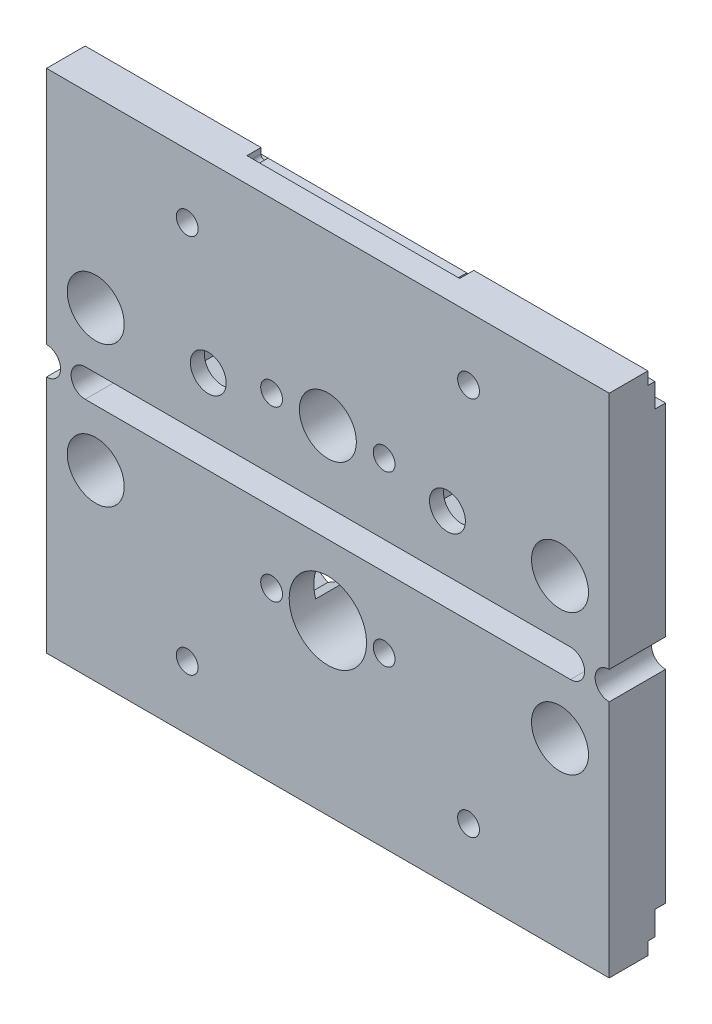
from build123d import *

# Parameters (mm, degrees)
SKETCH_2_W           = 80
SKETCH_2_H           = 34
SKETCH_2_R           = 4.05
EXTRUDE_1_DEPTH      = 8
SKETCH_3_R           = 2.55
CUT_EXTRUDE_1_DEPTH  = 88.292611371
CUT_EXTRUDE_2_DEPTH  = 88.292611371
SKETCH_5_R           = 1.55
CUT_EXTRUDE_3_DEPTH  = 88.292611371
CUT_EXTRUDE_4_DEPTH  = 6
CUT_EXTRUDE_5_DEPTH  = 4.5
SKETCH_25_R          = 1.55
CUT_EXTRUDE_13_DEPTH = 88.292611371
CUT_EXTRUDE_11_DEPTH = 2
EXTRUDE_2_DEPTH      = 8
SKETCH_26_R          = 5.5
CUT_EXTRUDE_14_DEPTH = 89.926936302


with BuildPart() as part:
    # Sketch 2 → Extrude 1 (new body)
    with BuildSketch(Plane.XY):
        with Locations((40, 17)):
            Rectangle(SKETCH_2_W, SKETCH_2_H)
        with Locations((7, 8)):
            Circle(SKETCH_2_R, mode=Mode.SUBTRACT)
        with Locations((40, 10)):
            Circle(SKETCH_2_R, mode=Mode.SUBTRACT)
        with Locations((73, 8)):
            Circle(SKETCH_2_R, mode=Mode.SUBTRACT)
    extrude_1 = extrude(amount=EXTRUDE_1_DEPTH)

    # Sketch 3 → Cut-Extrude 1 (cut, through all)
    with BuildSketch(Plane.XY.offset(8)):
        with Locations((23, 8)):
            Circle(SKETCH_3_R)
        with Locations((57, 8)):
            Circle(SKETCH_3_R)
    extrude(amount=-CUT_EXTRUDE_1_DEPTH, mode=Mode.SUBTRACT)

    # Sketch 4 → Cut-Extrude 2 (cut, through all)
    with BuildSketch(Plane(origin=(80, 0, 0), x_dir=(0, 0, -1), z_dir=(1, 0, 0))):
        Polygon((-1.5, 32.2), (-2.5, 32.2), (-2.5, 34), (0, 34), (0, 28.8), (-1.5, 28.8), align=None)
    cut_extrude_2 = extrude(amount=-CUT_EXTRUDE_2_DEPTH, mode=Mode.SUBTRACT)

    # Sketch 5 → Cut-Extrude 3 (cut, through all)
    with BuildSketch(Plane.XY.offset(8)):
        with Locations((48, 10)):
            Circle(SKETCH_5_R)
        with Locations((32, 10)):
            Circle(SKETCH_5_R)
    cut_extrude_3 = extrude(amount=-CUT_EXTRUDE_3_DEPTH, mode=Mode.SUBTRACT)

    # Sketch 7 → Cut-Extrude 4 (cut)
    with BuildSketch(Plane(origin=(0, 0, 0), x_dir=(-1, 0, 0), z_dir=(0, 0, -1))):
        Polygon((-52.9, 5.632863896), (-52.9, 10.367136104), (-57, 12.734272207), (-61.1, 10.367136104), (-61.1, 5.632863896), (-57, 3.265727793), align=None)
        Polygon((-27.1, 5.632863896), (-23, 3.265727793), (-18.9, 5.632863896), (-18.9, 10.367136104), (-23, 12.734272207), (-27.1, 10.367136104), align=None)
    extrude(amount=-CUT_EXTRUDE_4_DEPTH, mode=Mode.SUBTRACT)

    # Sketch 8 → Cut-Extrude 5 (cut)
    with BuildSketch(Plane(origin=(0, 0, 0), x_dir=(-1, 0, 0), z_dir=(0, 0, -1))):
        Polygon((-48, 6.709103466), (-45.15, 8.354551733), (-45.15, 11.645448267), (-48, 13.290896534), (-50.85, 11.645448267), (-50.85, 8.354551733), align=None)
        Polygon((-32, 6.709103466), (-29.15, 8.354551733), (-29.15, 11.645448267), (-32, 13.290896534), (-34.85, 11.645448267), (-34.85, 8.354551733), align=None)
    cut_extrude_5 = extrude(amount=-CUT_EXTRUDE_5_DEPTH, mode=Mode.SUBTRACT)

    # Sketch 25 → Cut-Extrude 13 (cut, through all)
    with BuildSketch(Plane(origin=(0, 0, 0), x_dir=(-1, 0, 0), z_dir=(0, 0, -1))):
        with Locations((-60, 25)):
            Circle(SKETCH_25_R)
        with Locations((-20, 25)):
            Circle(SKETCH_25_R)
    cut_extrude_13 = extrude(amount=-CUT_EXTRUDE_13_DEPTH, mode=Mode.SUBTRACT)

    # Sketch 19 → Cut-Extrude 11 (cut)
    with BuildSketch(Plane(origin=(0, 0, 2.5), x_dir=(-1, 0, 0), z_dir=(0, 0, -1))):
        with BuildLine():
            Line((-25, 34), (-55.247938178, 34))
            Line((-55.247938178, 34), (-55.247938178, 33.2))
            ThreePointArc((-55.247938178, 33.2), (-54.747938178, 32.7), (-54.247938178, 33.2))
            Line((-54.247938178, 33.2), (-26, 33.2))
            ThreePointArc((-26, 33.2), (-25.5, 32.7), (-25, 33.2))
            Line((-25, 33.2), (-25, 34))
        make_face()
    cut_extrude_11 = extrude(amount=-CUT_EXTRUDE_11_DEPTH, mode=Mode.SUBTRACT)

    # Sketch 22 → Extrude 2 (add)
    with BuildSketch(Plane.XY.offset(8)):
        with BuildLine():
            Line((0, -4), (5.5, -4))
            ThreePointArc((5.5, -4), (3.5, -2), (5.5, 0))
            Line((5.5, 0), (0, 0))
            ThreePointArc((0, 0), (2, -2), (0, -4))
        make_face()
        with BuildLine():
            Line((80, 0), (74.5, 0))
            ThreePointArc((74.5, 0), (76.5, -2), (74.5, -4))
            Line((74.5, -4), (80, -4))
            ThreePointArc((80, -4), (78, -2), (80, 0))
        make_face()
    extrude(amount=-EXTRUDE_2_DEPTH)

    # Mirror 2: Extrude 1, Cut-Extrude 2, Cut-Extrude 3, Cut-Extrude 5, Cut-Extrude 13, Cut-Extrude 11 across plane
    add(extrude_1.mirror(Plane(origin=(0, -2, 0), x_dir=(0, 0, 1), z_dir=(0, -1, 0))))
    add(cut_extrude_2.mirror(Plane(origin=(0, -2, 0), x_dir=(0, 0, 1), z_dir=(0, -1, 0))), mode=Mode.SUBTRACT)
    add(cut_extrude_3.mirror(Plane(origin=(0, -2, 0), x_dir=(0, 0, 1), z_dir=(0, -1, 0))), mode=Mode.SUBTRACT)
    add(cut_extrude_5.mirror(Plane(origin=(0, -2, 0), x_dir=(0, 0, 1), z_dir=(0, -1, 0))), mode=Mode.SUBTRACT)
    add(cut_extrude_13.mirror(Plane(origin=(0, -2, 0), x_dir=(0, 0, 1), z_dir=(0, -1, 0))), mode=Mode.SUBTRACT)
    add(cut_extrude_11.mirror(Plane(origin=(0, -2, 0), x_dir=(0, 0, 1), z_dir=(0, -1, 0))), mode=Mode.SUBTRACT)

    # Sketch 26 → Cut-Extrude 14 (cut, through all)
    with BuildSketch(Plane(origin=(0, 0, 0), x_dir=(-1, 0, 0), z_dir=(0, 0, -1))):
        with Locations((-40, -14)):
            Circle(SKETCH_26_R)
    extrude(amount=-CUT_EXTRUDE_14_DEPTH, mode=Mode.SUBTRACT)


solid = part.part
